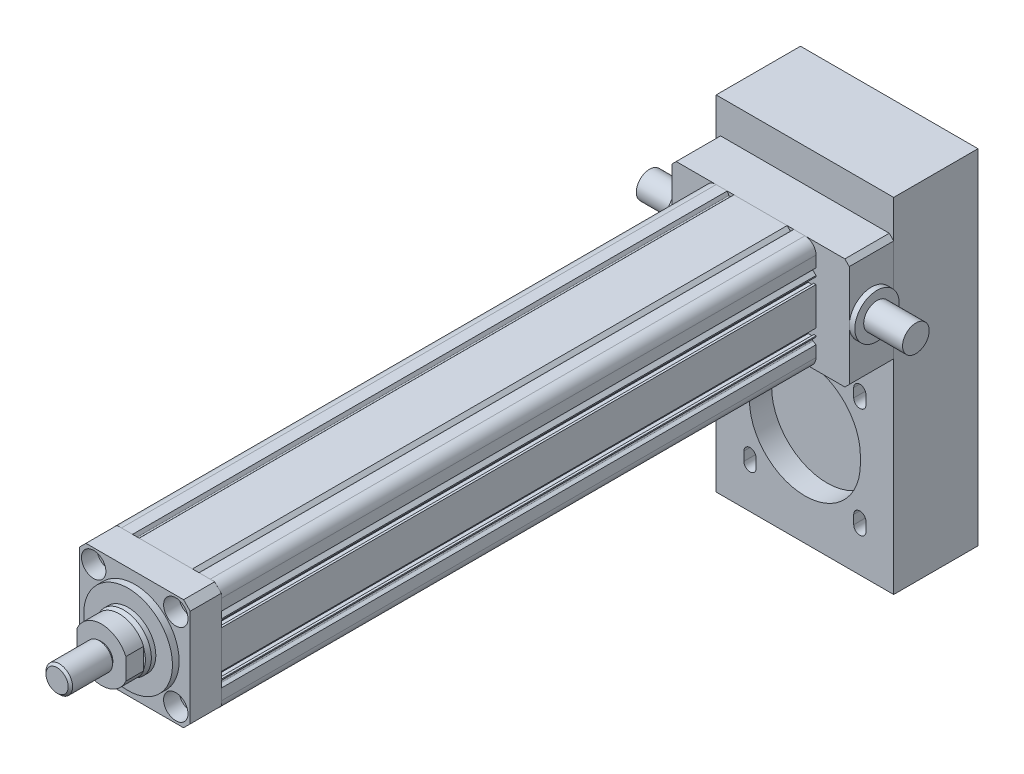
from build123d import *

# Parameters (mm, degrees)
SKETCH_1_R          = 20
SKETCH_1_R_2        = 2.75
EXTRUDE_1_DEPTH     = 268
FILLET_1_R          = 5
EXTRUDE_2_DEPTH     = 14
SKETCH_3_R          = 20
EXTRUDE_3_DEPTH     = 3
SKETCH_5_R          = 12.5
EXTRUDE_4_DEPTH     = 4
CHAMFER_1_SIZE      = 2
CHAMFER_1_SIZE2     = 0.7
EXTRUDE_5_DEPTH     = 8
SKETCH_7_R          = 5.15
EXTRUDE_6_DEPTH     = 1
SKETCH_8_R          = 6
EXTRUDE_7_DEPTH     = 19
CHAMFER_2_SIZE      = 1
SKETCH_23_W         = 80
SKETCH_23_H         = 50
EXTRUDE_8_DEPTH     = 20
SKETCH_4_R          = 3.5
CUT_EXTRUDE_5_DEPTH = 30
SKETCH_4_6_R        = 5.5
CUT_EXTRUDE_6_DEPTH = 7
SKETCH_35_W         = 80
SKETCH_35_H         = 155
EXTRUDE_10_DEPTH    = 38
CUT_EXTRUDE_7_DEPTH = 10
SKETCH_36_R         = 10
EXTRUDE_11_DEPTH    = 2.5
EXTRUDE_START       = -80
SKETCH_36_2_R       = 10
EXTRUDE_12_DEPTH    = 2.5
SKETCH_37_R         = 6
EXTRUDE_13_DEPTH    = 17.5
SKETCH_37_2_R       = 6
EXTRUDE_14_DEPTH    = 15
EXTRUDE_START_2     = -85
SKETCH_37_3_R       = 6
EXTRUDE_15_DEPTH    = 17.5
CHAMFER_3_SIZE      = 2


with BuildPart() as part:
    # Sketch 1 → Extrude 1 (new body)
    with BuildSketch(Plane.XY):
        with BuildLine():
            Line((-25, 25), (-15, 25))
            Line((-15, 25), (-14.227730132, 23.662389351))
            ThreePointArc((-14.227730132, 23.662389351), (-13.859980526, 23.416666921), (-13.441164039, 23.558835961))
            Line((-13.441164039, 23.558835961), (-12, 25))
            Line((-12, 25), (12, 25))
            Line((12, 25), (13.441164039, 23.558835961))
            ThreePointArc((13.441164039, 23.558835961), (13.859980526, 23.416666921), (14.227730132, 23.662389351))
            Line((14.227730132, 23.662389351), (15, 25))
            Line((15, 25), (25, 25))
            Line((25, 25), (25, 15))
            Line((25, 15), (23.662389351, 14.227730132))
            ThreePointArc((23.662389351, 14.227730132), (23.416666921, 13.859980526), (23.558835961, 13.441164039))
            Line((23.558835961, 13.441164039), (25, 12))
            Line((25, 12), (25, 11.5))
            Line((25, 11.5), (24, 11.5))
            Line((24, 11.5), (24, 12.4))
            Line((24, 12.4), (21.5, 12.4))
            Line((21.5, 12.4), (21.5, 7.6))
            Line((21.5, 7.6), (24, 7.6))
            Line((24, 7.6), (24, 8.5))
            Line((24, 8.5), (25, 8.5))
            Line((25, 8.5), (25, -8.5))
            Line((25, -8.5), (24, -8.5))
            Line((24, -8.5), (24, -7.6))
            Line((24, -7.6), (21.5, -7.6))
            Line((21.5, -7.6), (21.5, -12.4))
            Line((21.5, -12.4), (24, -12.4))
            Line((24, -12.4), (24, -11.5))
            Line((24, -11.5), (25, -11.5))
            Line((25, -11.5), (25, -12))
            Line((25, -12), (23.558835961, -13.441164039))
            ThreePointArc((23.558835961, -13.441164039), (23.416666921, -13.859980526), (23.662389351, -14.227730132))
            Line((23.662389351, -14.227730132), (25, -15))
            Line((25, -15), (25, -25))
            Line((25, -25), (15, -25))
            Line((15, -25), (14.227730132, -23.662389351))
            ThreePointArc((14.227730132, -23.662389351), (13.859980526, -23.416666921), (13.441164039, -23.558835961))
            Line((13.441164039, -23.558835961), (12, -25))
            Line((12, -25), (11.5, -25))
            Line((11.5, -25), (11.5, -24))
            Line((11.5, -24), (12.4, -24))
            Line((12.4, -24), (12.4, -21.5))
            Line((12.4, -21.5), (7.6, -21.5))
            Line((7.6, -21.5), (7.6, -24))
            Line((7.6, -24), (8.5, -24))
            Line((8.5, -24), (8.5, -25))
            Line((8.5, -25), (-8.5, -25))
            Line((-8.5, -25), (-8.5, -24))
            Line((-8.5, -24), (-7.6, -24))
            Line((-7.6, -24), (-7.6, -21.5))
            Line((-7.6, -21.5), (-12.4, -21.5))
            Line((-12.4, -21.5), (-12.4, -24))
            Line((-12.4, -24), (-11.5, -24))
            Line((-11.5, -24), (-11.5, -25))
            Line((-11.5, -25), (-12, -25))
            Line((-12, -25), (-13.441164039, -23.558835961))
            ThreePointArc((-13.441164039, -23.558835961), (-13.859980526, -23.416666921), (-14.227730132, -23.662389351))
            Line((-14.227730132, -23.662389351), (-15, -25))
            Line((-15, -25), (-25, -25))
            Line((-25, -25), (-25, -15))
            Line((-25, -15), (-23.662389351, -14.227730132))
            ThreePointArc((-23.662389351, -14.227730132), (-23.416666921, -13.859980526), (-23.558835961, -13.441164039))
            Line((-23.558835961, -13.441164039), (-25, -12))
            Line((-25, -12), (-25, -11.5))
            Line((-25, -11.5), (-24, -11.5))
            Line((-24, -11.5), (-24, -12.4))
            Line((-24, -12.4), (-21.5, -12.4))
            Line((-21.5, -12.4), (-21.5, -7.6))
            Line((-21.5, -7.6), (-24, -7.6))
            Line((-24, -7.6), (-24, -8.5))
            Line((-24, -8.5), (-25, -8.5))
            Line((-25, -8.5), (-25, 8.5))
            Line((-25, 8.5), (-24, 8.5))
            Line((-24, 8.5), (-24, 7.6))
            Line((-24, 7.6), (-21.5, 7.6))
            Line((-21.5, 7.6), (-21.5, 12.4))
            Line((-21.5, 12.4), (-24, 12.4))
            Line((-24, 12.4), (-24, 11.5))
            Line((-24, 11.5), (-25, 11.5))
            Line((-25, 11.5), (-25, 12))
            Line((-25, 12), (-23.558835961, 13.441164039))
            ThreePointArc((-23.558835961, 13.441164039), (-23.416666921, 13.859980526), (-23.662389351, 14.227730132))
            Line((-23.662389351, 14.227730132), (-25, 15))
            Line((-25, 15), (-25, 25))
        make_face()
        Circle(SKETCH_1_R, mode=Mode.SUBTRACT)
        with Locations((-18.5, 18.5)):
            Circle(SKETCH_1_R_2, mode=Mode.SUBTRACT)
        with Locations((18.5, 18.5)):
            Circle(SKETCH_1_R_2, mode=Mode.SUBTRACT)
        with Locations((18.5, -18.5)):
            Circle(SKETCH_1_R_2, mode=Mode.SUBTRACT)
        with Locations((-18.5, -18.5)):
            Circle(SKETCH_1_R_2, mode=Mode.SUBTRACT)
        with BuildLine():
            Line((-13.868836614, 23), (-5, 23))
            ThreePointArc((-5, 23), (-4.502985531, 22.554558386), (-4.891534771, 22.01190647))
            ThreePointArc((-4.891534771, 22.01190647), (-10.498377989, 19.955831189), (-15.368836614, 16.5))
            Line((-15.368836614, 16.5), (-15.368836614, 21.5))
            Line((-15.368836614, 21.5), (-13.868836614, 23))
        make_face(mode=Mode.SUBTRACT)
        with BuildLine():
            Line((15.368836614, 16.5), (15.368836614, 21.5))
            Line((15.368836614, 21.5), (13.868836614, 23))
            Line((13.868836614, 23), (5, 23))
            ThreePointArc((5, 23), (4.502985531, 22.554558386), (4.891534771, 22.01190647))
            ThreePointArc((4.891534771, 22.01190647), (10.498377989, 19.955831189), (15.368836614, 16.5))
        make_face(mode=Mode.SUBTRACT)
    extrude(amount=EXTRUDE_1_DEPTH)

    # Fillet 1
    fillet_1_edges = [part.edges().sort_by_distance(p)[0] for p in [
        (-25, 25, 134),
        (25, 25, 134),
        (25, -25, 134),
        (-25, -25, 134),
    ]]
    fillet(fillet_1_edges, radius=FILLET_1_R)


with BuildPart() as body_2:
    # Sketch 2 → Extrude 2 (new body)
    with BuildSketch(Plane.XY.offset(268)):
        Polygon((-25, 22), (-22, 25), (22, 25), (25, 22), (25, -22), (22, -25), (-22, -25), (-25, -22), align=None)
    extrude(amount=EXTRUDE_2_DEPTH)


with BuildPart() as body_3:
    # Sketch 3 → Extrude 3 (new body)
    with BuildSketch(Plane.XY.offset(282)):
        Circle(SKETCH_3_R)
    extrude(amount=EXTRUDE_3_DEPTH)


with BuildPart() as body_4:
    # Sketch 5 → Extrude 4 (new body)
    with BuildSketch(Plane.XY.offset(285)):
        Circle(SKETCH_5_R)
    extrude(amount=EXTRUDE_4_DEPTH)

    # Chamfer 1
    chamfer_1_edges = [body_4.edges().sort_by_distance(p)[0] for p in [
        (-12.5, 0, 289),
    ]]
    chamfer_1_side = [body_4.faces().sort_by_distance(p)[0] for p in [
        (-12.5, 0, 287),
    ]]
    chamfer(chamfer_1_edges, length=CHAMFER_1_SIZE, length2=CHAMFER_1_SIZE2, reference=chamfer_1_side[0])


with BuildPart() as body_5:
    # Sketch 6 → Extrude 5 (new body)
    with BuildSketch(Plane.XY.offset(289)):
        with BuildLine():
            Line((-11, 4.795831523), (-11, -4.795831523))
            ThreePointArc((-11, -4.795831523), (0, -12), (11, -4.795831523))
            Line((11, -4.795831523), (11, 4.795831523))
            ThreePointArc((11, 4.795831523), (0, 12), (-11, 4.795831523))
        make_face()
    extrude(amount=EXTRUDE_5_DEPTH)


with BuildPart() as body_6:
    # Sketch 7 → Extrude 6 (new body)
    with BuildSketch(Plane.XY.offset(297)):
        Circle(SKETCH_7_R)
    extrude(amount=EXTRUDE_6_DEPTH)


with BuildPart() as body_7:
    # Sketch 8 → Extrude 7 (new body)
    with BuildSketch(Plane.XY.offset(298)):
        Circle(SKETCH_8_R)
    extrude(amount=EXTRUDE_7_DEPTH)

    # Chamfer 2
    chamfer_2_edges = [body_7.edges().sort_by_distance(p)[0] for p in [
        (-6, 0, 317),
    ]]
    chamfer(chamfer_2_edges, length=CHAMFER_2_SIZE)


with BuildPart() as body_8:
    # Sketch 23 → Extrude 8 (new body)
    with BuildSketch(Plane(origin=(0, 0, 0), x_dir=(-1, 0, 0), z_dir=(0, 0, -1))):
        Rectangle(SKETCH_23_W, SKETCH_23_H)
    extrude(amount=EXTRUDE_8_DEPTH)

    # Sketch 27 → Hole Wizard M6 _1 (revolve, cut)
    with BuildSketch(Plane(origin=(0, -25, -12), x_dir=(0, 0, -1), z_dir=(1, 0, 0))):
        Polygon((0, 0), (0, 8.502151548), (2.5, 7), (2.5, 0), align=None)
    revolve(axis=Axis((0, -31.35, -12), (0, 1, 0)), mode=Mode.SUBTRACT)

    # Chamfer 3
    chamfer_3_edges = [body_8.edges().sort_by_distance(p)[0] for p in [
        (40, 25, -10),
        (-40, 25, -10),
        (-40, -25, -10),
        (40, -25, -10),
    ]]
    chamfer(chamfer_3_edges, length=CHAMFER_3_SIZE)


with BuildPart() as cut_extrude_5_tool:
    # Sketch 4 → Cut-Extrude 5 (new body)
    with BuildSketch(Plane.XY.offset(282)):
        with Locations((-35, 17.5)):
            Circle(SKETCH_4_R)
        with Locations((-18.5, 18.5)):
            Circle(SKETCH_4_R)
        with Locations(Location((-18.5, -18.5, 0), (0, 0, 180))):
            Circle(SKETCH_4_R)
        with Locations((-35, -17.5)):
            Circle(SKETCH_4_R)
        with Locations((35, -17.5)):
            Circle(SKETCH_4_R)
        with Locations((18.5, -18.5)):
            Circle(SKETCH_4_R)
        with Locations(Location((18.5, 18.5, 0), (0, 0, 180))):
            Circle(SKETCH_4_R)
        with Locations((35, 17.5)):
            Circle(SKETCH_4_R)
    extrude(amount=-CUT_EXTRUDE_5_DEPTH)


with BuildPart() as part_1:
    add(part.part)

    # Cut-Extrude 5: cut by cut_extrude_5_tool
    add(cut_extrude_5_tool.part, mode=Mode.SUBTRACT)


with BuildPart() as body_2_1:
    add(body_2.part)

    # Cut-Extrude 5: cut by cut_extrude_5_tool
    add(cut_extrude_5_tool.part, mode=Mode.SUBTRACT)

    # Sketch 4_6 → Cut-Extrude 6 (cut)
    with BuildSketch(Plane.XY.offset(282)):
        with Locations((-18.5, 18.5)):
            Circle(SKETCH_4_6_R)
        with Locations(Location((-18.5, -18.5, 0), (0, 0, 180))):
            Circle(SKETCH_4_6_R)
        with Locations((18.5, -18.5)):
            Circle(SKETCH_4_6_R)
        with Locations(Location((18.5, 18.5, 0), (0, 0, 180))):
            Circle(SKETCH_4_6_R)
    extrude(amount=-CUT_EXTRUDE_6_DEPTH, mode=Mode.SUBTRACT)


with BuildPart() as body_9:
    # Sketch 35 → Extrude 10 (new body)
    with BuildSketch(Plane(origin=(0, 0, -20), x_dir=(-1, 0, 0), z_dir=(0, 0, -1))):
        with Locations((0, -37.5)):
            Rectangle(SKETCH_35_W, SKETCH_35_H)
    extrude(amount=EXTRUDE_10_DEPTH)

    # Sketch 35_6 → Cut-Extrude 7 (cut)
    with BuildSketch(Plane(origin=(0, 0, -20), x_dir=(-1, 0, 0), z_dir=(0, 0, -1))):
        with BuildLine():
            Line((25, -68.5), (25, -71.5))
            ThreePointArc((25, -71.5), (-0.002360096, -96.499999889), (-24.999999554, -71.495279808))
            Line((-24.999999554, -71.495279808), (-24.999464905, -68.663567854))
            ThreePointArc((-24.999464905, -68.663567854), (-0.081784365, -43.500133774), (25, -68.5))
        make_face()
        with BuildLine():
            Line((27.498737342, -92.748737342), (27.498737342, -96.748737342))
            ThreePointArc((27.498737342, -96.748737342), (24.748737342, -99.498737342), (21.998737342, -96.748737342))
            Line((21.998737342, -96.748737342), (21.998737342, -92.748737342))
            ThreePointArc((21.998737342, -92.748737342), (24.748737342, -89.998737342), (27.498737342, -92.748737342))
        make_face()
        with BuildLine():
            Line((-27.498737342, -92.748737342), (-27.498737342, -96.748737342))
            ThreePointArc((-27.498737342, -96.748737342), (-24.748737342, -99.498737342), (-21.998737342, -96.748737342))
            Line((-21.998737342, -96.748737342), (-21.998737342, -92.748737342))
            ThreePointArc((-21.998737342, -92.748737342), (-24.748737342, -89.998737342), (-27.498737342, -92.748737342))
        make_face()
        with BuildLine():
            Line((-27.498737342, -47.251262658), (-27.498737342, -43.251262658))
            ThreePointArc((-27.498737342, -43.251262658), (-24.748737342, -40.501262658), (-21.998737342, -43.251262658))
            Line((-21.998737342, -43.251262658), (-21.998737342, -47.251262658))
            ThreePointArc((-21.998737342, -47.251262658), (-24.748737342, -50.001262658), (-27.498737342, -47.251262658))
        make_face()
        with BuildLine():
            Line((27.498737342, -47.251262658), (27.498737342, -43.251262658))
            ThreePointArc((27.498737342, -43.251262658), (24.748737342, -40.501262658), (21.998737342, -43.251262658))
            Line((21.998737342, -43.251262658), (21.998737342, -47.251262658))
            ThreePointArc((21.998737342, -47.251262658), (24.748737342, -50.001262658), (27.498737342, -47.251262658))
        make_face()
    extrude(amount=CUT_EXTRUDE_7_DEPTH, mode=Mode.SUBTRACT)


with BuildPart() as body_10:
    # Sketch 36 → Extrude 11 (new body)
    with BuildSketch(Plane(origin=(40, 0, 0), x_dir=(0, 0, -1), z_dir=(1, 0, 0))):
        with Locations((10, 0)):
            Circle(SKETCH_36_R)
    extrude(amount=EXTRUDE_11_DEPTH)

    # Sketch 37 → Extrude 13 (add)
    with BuildSketch(Plane(origin=(42.5, 0, 0), x_dir=(0, 0, -1), z_dir=(1, 0, 0))):
        with Locations((10, 0)):
            Circle(SKETCH_37_R)
    extrude(amount=EXTRUDE_13_DEPTH)

    # Sketch 37_2 → Extrude 14 (add)
    with BuildSketch(Plane(origin=(42.5, 0, 0), x_dir=(0, 0, -1), z_dir=(1, 0, 0))):
        with Locations((10, 0)):
            Circle(SKETCH_37_2_R)
    extrude(amount=EXTRUDE_14_DEPTH)


with BuildPart() as body_11:
    # Sketch 36_2 → Extrude 12 (new body)
    with BuildSketch(Plane(origin=(40, 0, 0), x_dir=(0, 0, -1), z_dir=(1, 0, 0)).offset(EXTRUDE_START)):
        with Locations((10, 0)):
            Circle(SKETCH_36_2_R)
    extrude(amount=-EXTRUDE_12_DEPTH)

    # Sketch 37_3 → Extrude 15 (add)
    with BuildSketch(Plane(origin=(42.5, 0, 0), x_dir=(0, 0, -1), z_dir=(1, 0, 0)).offset(EXTRUDE_START_2)):
        with Locations((10, 0)):
            Circle(SKETCH_37_3_R)
    extrude(amount=-EXTRUDE_15_DEPTH)


solid = Compound([body_3.part, body_4.part, body_5.part, body_6.part, body_7.part, body_8.part, part_1.part, body_2_1.part, body_9.part, body_10.part, body_11.part])
